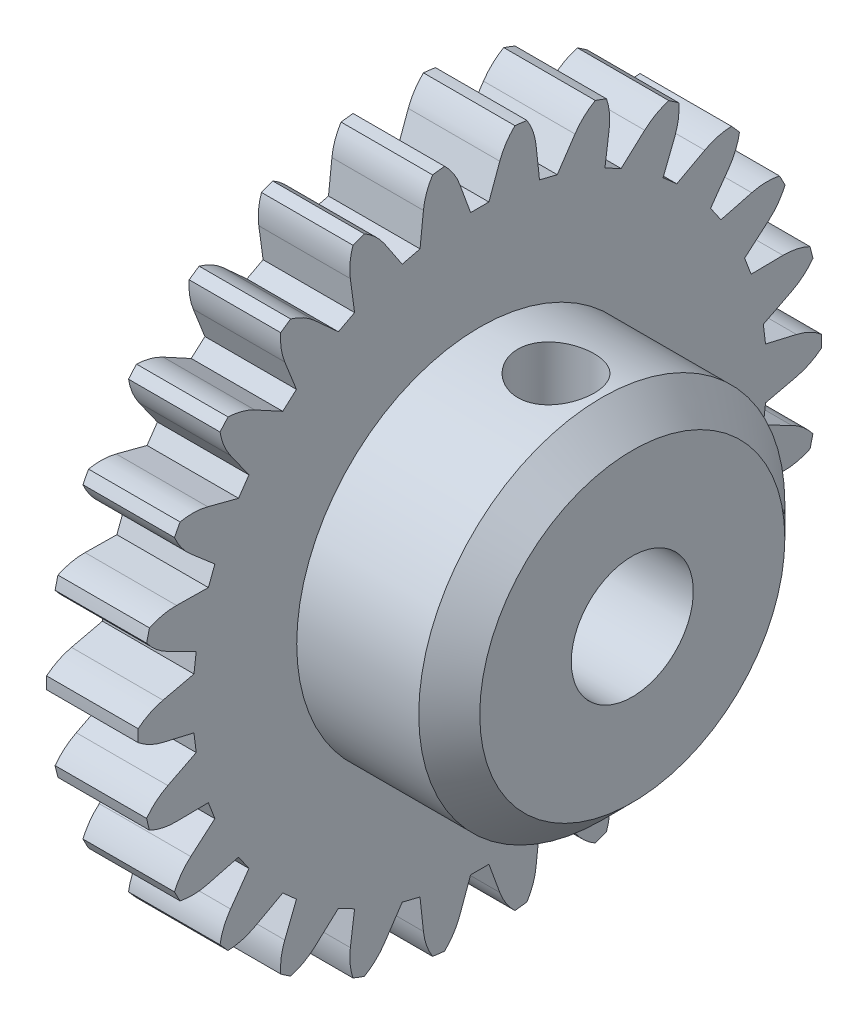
from build123d import *

# Parameters (mm, degrees)
ENL_V_MAT_EXTRU_1_DEPTH      = 18.74485841
R_P_TITION_CIRCULAIRE1_COUNT = 26
CHANFREIN1_SIZE              = 1
ESQUISSE3_R                  = 1.25
ENL_V_MAT_EXTRU_2_DEPTH      = 20


with BuildPart() as part:
    # Esquisse1 → R_volution1 (revolve)
    with BuildSketch(Plane.XY, mode=Mode.PRIVATE) as r_volution1_sk:
        Polygon((0, 2), (8, 2), (8, 6), (3, 6), (3, 11.2), (0, 11.2), align=None)
    revolve(r_volution1_sk.sketch.rotate(Axis((-19.448313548, 0, 0), (1, 0, 0)), 90), axis=Axis((-19.448313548, 0, 0), (1, 0, 0)))

    # Esquisse2 → Enl_v. mat.-Extru.1 (cut, through all)
    with BuildSketch(Plane.ZY):
        with BuildLine():
            Line((1.351810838, 11.307101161), (-1.351810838, 11.307101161))
            ThreePointArc((-1.351810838, 11.307101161), (-0.93540221, 10.894681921), (-0.656422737, 10.379263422))
            Line((-0.656422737, 10.379263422), (-0.3, 9.4))
            Line((-0.3, 9.4), (0.3, 9.4))
            Line((0.3, 9.4), (0.656422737, 10.379263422))
            ThreePointArc((0.656422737, 10.379263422), (0.93540221, 10.894681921), (1.351810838, 11.307101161))
        make_face()
    enl_v_mat_extru_1 = extrude(amount=-ENL_V_MAT_EXTRU_1_DEPTH, mode=Mode.SUBTRACT)

    # R_p_tition circulaire1: Enl_v. mat.-Extru.1 ×26 about axis
    r_p_tition_circulaire1_axis = Axis((0, 0, 0), (1, 0, 0))
    for i in range(1, R_P_TITION_CIRCULAIRE1_COUNT):
        add(enl_v_mat_extru_1.rotate(r_p_tition_circulaire1_axis, i * 360 / R_P_TITION_CIRCULAIRE1_COUNT), mode=Mode.SUBTRACT)

    # Chanfrein1
    chanfrein1_edges = [part.edges().sort_by_distance(p)[0] for p in [
        (8, 0, -6),
    ]]
    chamfer(chanfrein1_edges, length=CHANFREIN1_SIZE)

    # Esquisse3 → Enl_v. mat.-Extru.2 (cut)
    with BuildSketch(Plane(origin=(0, 0, 0), x_dir=(1, 0, 0), z_dir=(0, 1, 0))):
        with Locations(Location((5.5, 0, 0), (0, 0, 90))):
            Circle(ESQUISSE3_R)
    extrude(amount=ENL_V_MAT_EXTRU_2_DEPTH, mode=Mode.SUBTRACT)


solid = part.part
